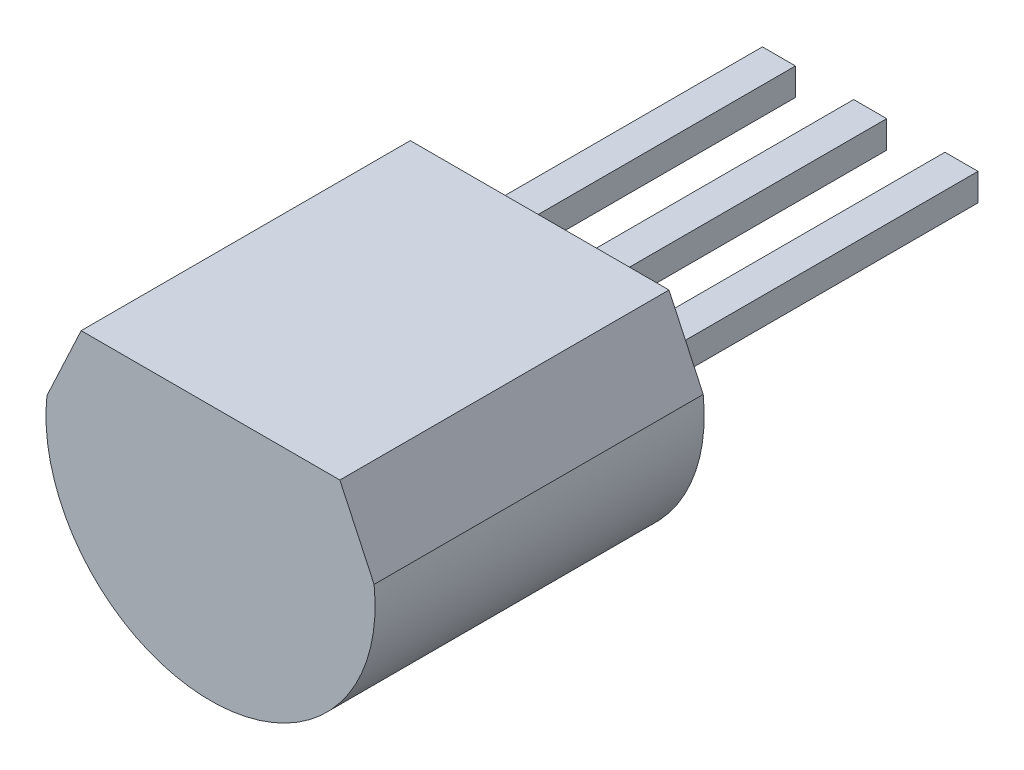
ISO-10303-21;
HEADER;
FILE_DESCRIPTION(('STEP AP214'),'2;1');
FILE_NAME('part.step','',(''),(''),'','','');
FILE_SCHEMA(('AUTOMOTIVE_DESIGN { 1 0 10303 214 1 1 1 1 }'));
ENDSEC;
DATA;
#1=APPLICATION_CONTEXT('core data for automotive mechanical design processes');
#2=APPLICATION_PROTOCOL_DEFINITION('international standard','automotive_design',2000,#1);
#3=PRODUCT_CONTEXT('',#1,'mechanical');
#4=PRODUCT('Part','Part','',(#3));
#5=PRODUCT_RELATED_PRODUCT_CATEGORY('part','',(#4));
#6=PRODUCT_DEFINITION_FORMATION('','',#4);
#7=PRODUCT_DEFINITION_CONTEXT('part definition',#1,'design');
#8=PRODUCT_DEFINITION('design','',#6,#7);
#9=PRODUCT_DEFINITION_SHAPE('','',#8);
#10=(LENGTH_UNIT() NAMED_UNIT(*) SI_UNIT(.MILLI.,.METRE.));
#11=(NAMED_UNIT(*) PLANE_ANGLE_UNIT() SI_UNIT($,.RADIAN.));
#12=(NAMED_UNIT(*) SI_UNIT($,.STERADIAN.) SOLID_ANGLE_UNIT());
#13=UNCERTAINTY_MEASURE_WITH_UNIT(LENGTH_MEASURE(1.E-05),#10,'distance_accuracy_value','');
#14=(GEOMETRIC_REPRESENTATION_CONTEXT(3) GLOBAL_UNCERTAINTY_ASSIGNED_CONTEXT((#13)) GLOBAL_UNIT_ASSIGNED_CONTEXT((#10,
#11,#12)) REPRESENTATION_CONTEXT('',''));
#15=CARTESIAN_POINT('',(0.,0.,0.));
#16=DIRECTION('',(0.,0.,1.));
#17=DIRECTION('',(1.,0.,0.));
#18=AXIS2_PLACEMENT_3D('',#15,#16,#17);
#19=CARTESIAN_POINT('',(1.5,0.19,-3.));
#20=DIRECTION('',(0.,1.,0.));
#21=DIRECTION('',(0.,0.,1.));
#22=AXIS2_PLACEMENT_3D('',#19,#20,#21);
#23=PLANE('',#22);
#24=DIRECTION('',(1.,0.,0.));
#25=VECTOR('',#24,1.);
#26=CARTESIAN_POINT('',(1.04,0.19,1.6));
#27=LINE('',#26,#25);
#28=CARTESIAN_POINT('',(1.5,0.19,1.6));
#29=VERTEX_POINT('',#28);
#30=CARTESIAN_POINT('',(1.04,0.19,1.6));
#31=VERTEX_POINT('',#30);
#32=EDGE_CURVE('P0_E68',#29,#31,#27,.F.);
#33=ORIENTED_EDGE('',*,*,#32,.F.);
#34=DIRECTION('',(0.,0.,-1.));
#35=VECTOR('',#34,1.);
#36=CARTESIAN_POINT('',(1.5,0.19,-3.));
#37=LINE('',#36,#35);
#38=CARTESIAN_POINT('',(1.5,0.19,-3.));
#39=VERTEX_POINT('',#38);
#40=EDGE_CURVE('P0_E55',#39,#29,#37,.F.);
#41=ORIENTED_EDGE('',*,*,#40,.F.);
#42=DIRECTION('',(-1.,0.,0.));
#43=VECTOR('',#42,1.);
#44=CARTESIAN_POINT('',(1.04,0.19,-3.));
#45=LINE('',#44,#43);
#46=CARTESIAN_POINT('',(1.04,0.19,-3.));
#47=VERTEX_POINT('',#46);
#48=EDGE_CURVE('P0_E20',#47,#39,#45,.F.);
#49=ORIENTED_EDGE('',*,*,#48,.F.);
#50=DIRECTION('',(0.,0.,1.));
#51=VECTOR('',#50,1.);
#52=CARTESIAN_POINT('',(1.04,0.19,-3.));
#53=LINE('',#52,#51);
#54=EDGE_CURVE('P0_E81',#31,#47,#53,.F.);
#55=ORIENTED_EDGE('',*,*,#54,.F.);
#56=EDGE_LOOP('',(#33,#41,#49,#55));
#57=FACE_BOUND('',#56,.T.);
#58=ADVANCED_FACE('P0_F17',(#57),#23,.T.);
#59=CARTESIAN_POINT('',(1.04,-0.19,-3.));
#60=DIRECTION('',(0.,0.,-1.));
#61=DIRECTION('',(-1.,0.,0.));
#62=AXIS2_PLACEMENT_3D('',#59,#60,#61);
#63=PLANE('',#62);
#64=DIRECTION('',(0.,1.,0.));
#65=VECTOR('',#64,1.);
#66=CARTESIAN_POINT('',(1.5,-0.19,-3.));
#67=LINE('',#66,#65);
#68=CARTESIAN_POINT('',(1.5,-0.19,-3.));
#69=VERTEX_POINT('',#68);
#70=EDGE_CURVE('P0_E61',#69,#39,#67,.T.);
#71=ORIENTED_EDGE('',*,*,#70,.F.);
#72=DIRECTION('',(1.,0.,0.));
#73=VECTOR('',#72,1.);
#74=CARTESIAN_POINT('',(1.04,-0.19,-3.));
#75=LINE('',#74,#73);
#76=CARTESIAN_POINT('',(1.04,-0.19,-3.));
#77=VERTEX_POINT('',#76);
#78=EDGE_CURVE('P0_E83',#77,#69,#75,.T.);
#79=ORIENTED_EDGE('',*,*,#78,.F.);
#80=DIRECTION('',(0.,1.,0.));
#81=VECTOR('',#80,1.);
#82=CARTESIAN_POINT('',(1.04,0.19,-3.));
#83=LINE('',#82,#81);
#84=EDGE_CURVE('P0_E64',#47,#77,#83,.F.);
#85=ORIENTED_EDGE('',*,*,#84,.F.);
#86=ORIENTED_EDGE('',*,*,#48,.T.);
#87=EDGE_LOOP('',(#71,#79,#85,#86));
#88=FACE_BOUND('',#87,.T.);
#89=ADVANCED_FACE('P0_F60',(#88),#63,.T.);
#90=CARTESIAN_POINT('',(1.5,-0.19,-3.));
#91=DIRECTION('',(1.,0.,0.));
#92=DIRECTION('',(0.,0.,-1.));
#93=AXIS2_PLACEMENT_3D('',#90,#91,#92);
#94=PLANE('',#93);
#95=DIRECTION('',(0.,1.,0.));
#96=VECTOR('',#95,1.);
#97=CARTESIAN_POINT('',(1.5,-0.19,1.6));
#98=LINE('',#97,#96);
#99=CARTESIAN_POINT('',(1.5,-0.19,1.6));
#100=VERTEX_POINT('',#99);
#101=EDGE_CURVE('P0_E70',#100,#29,#98,.T.);
#102=ORIENTED_EDGE('',*,*,#101,.F.);
#103=DIRECTION('',(0.,0.,-1.));
#104=VECTOR('',#103,1.);
#105=CARTESIAN_POINT('',(1.5,-0.19,-3.));
#106=LINE('',#105,#104);
#107=EDGE_CURVE('P0_E74',#69,#100,#106,.F.);
#108=ORIENTED_EDGE('',*,*,#107,.F.);
#109=ORIENTED_EDGE('',*,*,#70,.T.);
#110=ORIENTED_EDGE('',*,*,#40,.T.);
#111=EDGE_LOOP('',(#102,#108,#109,#110));
#112=FACE_BOUND('',#111,.T.);
#113=ADVANCED_FACE('P0_F72',(#112),#94,.T.);
#114=CARTESIAN_POINT('',(1.04,-0.19,1.6));
#115=DIRECTION('',(0.,0.,1.));
#116=DIRECTION('',(1.,0.,0.));
#117=AXIS2_PLACEMENT_3D('',#114,#115,#116);
#118=PLANE('',#117);
#119=ORIENTED_EDGE('',*,*,#32,.T.);
#120=DIRECTION('',(0.,1.,0.));
#121=VECTOR('',#120,1.);
#122=CARTESIAN_POINT('',(1.04,0.19,1.6));
#123=LINE('',#122,#121);
#124=CARTESIAN_POINT('',(1.04,-0.19,1.6));
#125=VERTEX_POINT('',#124);
#126=EDGE_CURVE('P0_E35',#125,#31,#123,.T.);
#127=ORIENTED_EDGE('',*,*,#126,.F.);
#128=DIRECTION('',(1.,0.,0.));
#129=VECTOR('',#128,1.);
#130=CARTESIAN_POINT('',(1.04,-0.19,1.6));
#131=LINE('',#130,#129);
#132=EDGE_CURVE('P0_E26',#100,#125,#131,.F.);
#133=ORIENTED_EDGE('',*,*,#132,.F.);
#134=ORIENTED_EDGE('',*,*,#101,.T.);
#135=EDGE_LOOP('',(#119,#127,#133,#134));
#136=FACE_BOUND('',#135,.T.);
#137=ADVANCED_FACE('P0_F89',(#136),#118,.T.);
#138=CARTESIAN_POINT('',(1.04,0.19,-3.));
#139=DIRECTION('',(-1.,0.,0.));
#140=DIRECTION('',(0.,0.,1.));
#141=AXIS2_PLACEMENT_3D('',#138,#139,#140);
#142=PLANE('',#141);
#143=ORIENTED_EDGE('',*,*,#126,.T.);
#144=ORIENTED_EDGE('',*,*,#54,.T.);
#145=ORIENTED_EDGE('',*,*,#84,.T.);
#146=DIRECTION('',(0.,0.,-1.));
#147=VECTOR('',#146,1.);
#148=CARTESIAN_POINT('',(1.04,-0.19,-3.));
#149=LINE('',#148,#147);
#150=EDGE_CURVE('P0_E11',#125,#77,#149,.T.);
#151=ORIENTED_EDGE('',*,*,#150,.F.);
#152=EDGE_LOOP('',(#143,#144,#145,#151));
#153=FACE_BOUND('',#152,.T.);
#154=ADVANCED_FACE('P0_F91',(#153),#142,.T.);
#155=CARTESIAN_POINT('',(1.04,-0.19,-3.));
#156=DIRECTION('',(0.,-1.,0.));
#157=DIRECTION('',(0.,0.,-1.));
#158=AXIS2_PLACEMENT_3D('',#155,#156,#157);
#159=PLANE('',#158);
#160=ORIENTED_EDGE('',*,*,#132,.T.);
#161=ORIENTED_EDGE('',*,*,#150,.T.);
#162=ORIENTED_EDGE('',*,*,#78,.T.);
#163=ORIENTED_EDGE('',*,*,#107,.T.);
#164=EDGE_LOOP('',(#160,#161,#162,#163));
#165=FACE_BOUND('',#164,.T.);
#166=ADVANCED_FACE('P0_F88',(#165),#159,.T.);
#167=CLOSED_SHELL('',(#58,#89,#113,#137,#154,#166));
#168=MANIFOLD_SOLID_BREP('P0_B1',#167);
#169=CARTESIAN_POINT('',(0.23,0.19,-3.));
#170=DIRECTION('',(0.,1.,0.));
#171=DIRECTION('',(0.,0.,1.));
#172=AXIS2_PLACEMENT_3D('',#169,#170,#171);
#173=PLANE('',#172);
#174=DIRECTION('',(1.,0.,0.));
#175=VECTOR('',#174,1.);
#176=CARTESIAN_POINT('',(-0.23,0.19,1.6));
#177=LINE('',#176,#175);
#178=CARTESIAN_POINT('',(0.23,0.19,1.6));
#179=VERTEX_POINT('',#178);
#180=CARTESIAN_POINT('',(-0.23,0.19,1.6));
#181=VERTEX_POINT('',#180);
#182=EDGE_CURVE('P1_E68',#179,#181,#177,.F.);
#183=ORIENTED_EDGE('',*,*,#182,.F.);
#184=DIRECTION('',(0.,0.,-1.));
#185=VECTOR('',#184,1.);
#186=CARTESIAN_POINT('',(0.23,0.19,-3.));
#187=LINE('',#186,#185);
#188=CARTESIAN_POINT('',(0.23,0.19,-3.));
#189=VERTEX_POINT('',#188);
#190=EDGE_CURVE('P1_E55',#189,#179,#187,.F.);
#191=ORIENTED_EDGE('',*,*,#190,.F.);
#192=DIRECTION('',(-1.,0.,0.));
#193=VECTOR('',#192,1.);
#194=CARTESIAN_POINT('',(-0.23,0.19,-3.));
#195=LINE('',#194,#193);
#196=CARTESIAN_POINT('',(-0.23,0.19,-3.));
#197=VERTEX_POINT('',#196);
#198=EDGE_CURVE('P1_E20',#197,#189,#195,.F.);
#199=ORIENTED_EDGE('',*,*,#198,.F.);
#200=DIRECTION('',(0.,0.,1.));
#201=VECTOR('',#200,1.);
#202=CARTESIAN_POINT('',(-0.23,0.19,-3.));
#203=LINE('',#202,#201);
#204=EDGE_CURVE('P1_E81',#181,#197,#203,.F.);
#205=ORIENTED_EDGE('',*,*,#204,.F.);
#206=EDGE_LOOP('',(#183,#191,#199,#205));
#207=FACE_BOUND('',#206,.T.);
#208=ADVANCED_FACE('P1_F17',(#207),#173,.T.);
#209=CARTESIAN_POINT('',(-0.23,-0.19,-3.));
#210=DIRECTION('',(0.,0.,-1.));
#211=DIRECTION('',(-1.,0.,0.));
#212=AXIS2_PLACEMENT_3D('',#209,#210,#211);
#213=PLANE('',#212);
#214=DIRECTION('',(0.,1.,0.));
#215=VECTOR('',#214,1.);
#216=CARTESIAN_POINT('',(0.23,-0.19,-3.));
#217=LINE('',#216,#215);
#218=CARTESIAN_POINT('',(0.23,-0.19,-3.));
#219=VERTEX_POINT('',#218);
#220=EDGE_CURVE('P1_E61',#219,#189,#217,.T.);
#221=ORIENTED_EDGE('',*,*,#220,.F.);
#222=DIRECTION('',(1.,0.,0.));
#223=VECTOR('',#222,1.);
#224=CARTESIAN_POINT('',(-0.23,-0.19,-3.));
#225=LINE('',#224,#223);
#226=CARTESIAN_POINT('',(-0.23,-0.19,-3.));
#227=VERTEX_POINT('',#226);
#228=EDGE_CURVE('P1_E83',#227,#219,#225,.T.);
#229=ORIENTED_EDGE('',*,*,#228,.F.);
#230=DIRECTION('',(0.,1.,0.));
#231=VECTOR('',#230,1.);
#232=CARTESIAN_POINT('',(-0.23,0.19,-3.));
#233=LINE('',#232,#231);
#234=EDGE_CURVE('P1_E64',#197,#227,#233,.F.);
#235=ORIENTED_EDGE('',*,*,#234,.F.);
#236=ORIENTED_EDGE('',*,*,#198,.T.);
#237=EDGE_LOOP('',(#221,#229,#235,#236));
#238=FACE_BOUND('',#237,.T.);
#239=ADVANCED_FACE('P1_F60',(#238),#213,.T.);
#240=CARTESIAN_POINT('',(0.23,-0.19,-3.));
#241=DIRECTION('',(1.,0.,0.));
#242=DIRECTION('',(0.,0.,-1.));
#243=AXIS2_PLACEMENT_3D('',#240,#241,#242);
#244=PLANE('',#243);
#245=DIRECTION('',(0.,1.,0.));
#246=VECTOR('',#245,1.);
#247=CARTESIAN_POINT('',(0.23,-0.19,1.6));
#248=LINE('',#247,#246);
#249=CARTESIAN_POINT('',(0.23,-0.19,1.6));
#250=VERTEX_POINT('',#249);
#251=EDGE_CURVE('P1_E70',#250,#179,#248,.T.);
#252=ORIENTED_EDGE('',*,*,#251,.F.);
#253=DIRECTION('',(0.,0.,-1.));
#254=VECTOR('',#253,1.);
#255=CARTESIAN_POINT('',(0.23,-0.19,-3.));
#256=LINE('',#255,#254);
#257=EDGE_CURVE('P1_E74',#219,#250,#256,.F.);
#258=ORIENTED_EDGE('',*,*,#257,.F.);
#259=ORIENTED_EDGE('',*,*,#220,.T.);
#260=ORIENTED_EDGE('',*,*,#190,.T.);
#261=EDGE_LOOP('',(#252,#258,#259,#260));
#262=FACE_BOUND('',#261,.T.);
#263=ADVANCED_FACE('P1_F72',(#262),#244,.T.);
#264=CARTESIAN_POINT('',(-0.23,-0.19,1.6));
#265=DIRECTION('',(0.,0.,1.));
#266=DIRECTION('',(1.,0.,0.));
#267=AXIS2_PLACEMENT_3D('',#264,#265,#266);
#268=PLANE('',#267);
#269=ORIENTED_EDGE('',*,*,#182,.T.);
#270=DIRECTION('',(0.,1.,0.));
#271=VECTOR('',#270,1.);
#272=CARTESIAN_POINT('',(-0.23,0.19,1.6));
#273=LINE('',#272,#271);
#274=CARTESIAN_POINT('',(-0.23,-0.19,1.6));
#275=VERTEX_POINT('',#274);
#276=EDGE_CURVE('P1_E35',#275,#181,#273,.T.);
#277=ORIENTED_EDGE('',*,*,#276,.F.);
#278=DIRECTION('',(1.,0.,0.));
#279=VECTOR('',#278,1.);
#280=CARTESIAN_POINT('',(-0.23,-0.19,1.6));
#281=LINE('',#280,#279);
#282=EDGE_CURVE('P1_E26',#250,#275,#281,.F.);
#283=ORIENTED_EDGE('',*,*,#282,.F.);
#284=ORIENTED_EDGE('',*,*,#251,.T.);
#285=EDGE_LOOP('',(#269,#277,#283,#284));
#286=FACE_BOUND('',#285,.T.);
#287=ADVANCED_FACE('P1_F89',(#286),#268,.T.);
#288=CARTESIAN_POINT('',(-0.23,0.19,-3.));
#289=DIRECTION('',(-1.,0.,0.));
#290=DIRECTION('',(0.,0.,1.));
#291=AXIS2_PLACEMENT_3D('',#288,#289,#290);
#292=PLANE('',#291);
#293=ORIENTED_EDGE('',*,*,#276,.T.);
#294=ORIENTED_EDGE('',*,*,#204,.T.);
#295=ORIENTED_EDGE('',*,*,#234,.T.);
#296=DIRECTION('',(0.,0.,-1.));
#297=VECTOR('',#296,1.);
#298=CARTESIAN_POINT('',(-0.23,-0.19,-3.));
#299=LINE('',#298,#297);
#300=EDGE_CURVE('P1_E11',#275,#227,#299,.T.);
#301=ORIENTED_EDGE('',*,*,#300,.F.);
#302=EDGE_LOOP('',(#293,#294,#295,#301));
#303=FACE_BOUND('',#302,.T.);
#304=ADVANCED_FACE('P1_F91',(#303),#292,.T.);
#305=CARTESIAN_POINT('',(-0.23,-0.19,-3.));
#306=DIRECTION('',(0.,-1.,0.));
#307=DIRECTION('',(0.,0.,-1.));
#308=AXIS2_PLACEMENT_3D('',#305,#306,#307);
#309=PLANE('',#308);
#310=ORIENTED_EDGE('',*,*,#282,.T.);
#311=ORIENTED_EDGE('',*,*,#300,.T.);
#312=ORIENTED_EDGE('',*,*,#228,.T.);
#313=ORIENTED_EDGE('',*,*,#257,.T.);
#314=EDGE_LOOP('',(#310,#311,#312,#313));
#315=FACE_BOUND('',#314,.T.);
#316=ADVANCED_FACE('P1_F88',(#315),#309,.T.);
#317=CLOSED_SHELL('',(#208,#239,#263,#287,#304,#316));
#318=MANIFOLD_SOLID_BREP('P1_B1',#317);
#319=CARTESIAN_POINT('',(1.8,1.21,1.6));
#320=DIRECTION('',(0.,1.,0.));
#321=DIRECTION('',(-1.,0.,0.));
#322=AXIS2_PLACEMENT_3D('',#319,#320,#321);
#323=PLANE('',#322);
#324=DIRECTION('',(1.,0.,0.));
#325=VECTOR('',#324,1.);
#326=CARTESIAN_POINT('',(-2.862499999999,1.21,6.18));
#327=LINE('',#326,#325);
#328=CARTESIAN_POINT('',(1.8,1.21,6.18));
#329=VERTEX_POINT('',#328);
#330=CARTESIAN_POINT('',(-1.8,1.21,6.18));
#331=VERTEX_POINT('',#330);
#332=EDGE_CURVE('P2_E67',#329,#331,#327,.F.);
#333=ORIENTED_EDGE('',*,*,#332,.F.);
#334=DIRECTION('',(0.,0.,1.));
#335=VECTOR('',#334,1.);
#336=CARTESIAN_POINT('',(1.8,1.21,3.89));
#337=LINE('',#336,#335);
#338=CARTESIAN_POINT('',(1.8,1.21,1.6));
#339=VERTEX_POINT('',#338);
#340=EDGE_CURVE('P2_E89',#339,#329,#337,.T.);
#341=ORIENTED_EDGE('',*,*,#340,.F.);
#342=DIRECTION('',(-1.,0.,0.));
#343=VECTOR('',#342,1.);
#344=CARTESIAN_POINT('',(-2.862499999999,1.21,1.6));
#345=LINE('',#344,#343);
#346=CARTESIAN_POINT('',(-1.8,1.21,1.6));
#347=VERTEX_POINT('',#346);
#348=EDGE_CURVE('P2_E78',#347,#339,#345,.F.);
#349=ORIENTED_EDGE('',*,*,#348,.F.);
#350=DIRECTION('',(0.,0.,-1.));
#351=VECTOR('',#350,1.);
#352=CARTESIAN_POINT('',(-1.8,1.21,3.89));
#353=LINE('',#352,#351);
#354=EDGE_CURVE('P2_E111',#331,#347,#353,.T.);
#355=ORIENTED_EDGE('',*,*,#354,.F.);
#356=EDGE_LOOP('',(#333,#341,#349,#355));
#357=FACE_BOUND('',#356,.T.);
#358=ADVANCED_FACE('P2_F17',(#357),#323,.T.);
#359=CARTESIAN_POINT('',(-0.79375,-2.1,3.09625));
#360=DIRECTION('',(0.,-1.,0.));
#361=DIRECTION('',(0.,0.,-1.));
#362=AXIS2_PLACEMENT_3D('',#359,#360,#361);
#363=PLANE('',#362);
#364=CARTESIAN_POINT('',(0.,-2.1,3.89));
#365=DIRECTION('',(0.,-1.,0.));
#366=DIRECTION('',(0.,0.,-1.));
#367=AXIS2_PLACEMENT_3D('',#364,#365,#366);
#368=CIRCLE('',#367,0.635000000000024);
#369=CARTESIAN_POINT('',(-0.635000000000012,-2.1,3.89));
#370=VERTEX_POINT('',#369);
#371=CARTESIAN_POINT('',(0.635000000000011,-2.1,3.89));
#372=VERTEX_POINT('',#371);
#373=EDGE_CURVE('P2_E60',#370,#372,#368,.F.);
#374=ORIENTED_EDGE('',*,*,#373,.F.);
#375=CARTESIAN_POINT('',(0.,-2.1,3.89));
#376=DIRECTION('',(0.,-1.,0.));
#377=DIRECTION('',(0.,0.,-1.));
#378=AXIS2_PLACEMENT_3D('',#375,#376,#377);
#379=CIRCLE('',#378,0.635000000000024);
#380=EDGE_CURVE('P2_E22',#372,#370,#379,.F.);
#381=ORIENTED_EDGE('',*,*,#380,.F.);
#382=EDGE_LOOP('',(#374,#381));
#383=FACE_BOUND('',#382,.T.);
#384=ADVANCED_FACE('P2_F144',(#383),#363,.T.);
#385=CARTESIAN_POINT('',(-2.862499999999,-2.795,1.6));
#386=DIRECTION('',(0.,0.,-1.));
#387=DIRECTION('',(-1.,0.,0.));
#388=AXIS2_PLACEMENT_3D('',#385,#386,#387);
#389=PLANE('',#388);
#390=DIRECTION('',(-0.423113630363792,0.906076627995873,0.));
#391=VECTOR('',#390,1.);
#392=CARTESIAN_POINT('',(2.038156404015,0.700000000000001,1.6));
#393=LINE('',#392,#391);
#394=CARTESIAN_POINT('',(2.27631280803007,0.189999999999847,1.6));
#395=VERTEX_POINT('',#394);
#396=EDGE_CURVE('P2_E82',#395,#339,#393,.T.);
#397=ORIENTED_EDGE('',*,*,#396,.F.);
#398=CARTESIAN_POINT('',(1.55257751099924E-13,-0.0600000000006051,1.6));
#399=DIRECTION('',(0.,0.,1.));
#400=DIRECTION('',(1.,0.,0.));
#401=AXIS2_PLACEMENT_3D('',#398,#399,#400);
#402=CIRCLE('',#401,2.29000000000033);
#403=CARTESIAN_POINT('',(-2.27631280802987,0.190000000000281,1.6));
#404=VERTEX_POINT('',#403);
#405=EDGE_CURVE('P2_E166',#404,#395,#402,.T.);
#406=ORIENTED_EDGE('',*,*,#405,.F.);
#407=DIRECTION('',(-0.423113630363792,-0.906076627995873,0.));
#408=VECTOR('',#407,1.);
#409=CARTESIAN_POINT('',(-2.038156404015,0.7,1.6));
#410=LINE('',#409,#408);
#411=EDGE_CURVE('P2_E85',#347,#404,#410,.T.);
#412=ORIENTED_EDGE('',*,*,#411,.F.);
#413=ORIENTED_EDGE('',*,*,#348,.T.);
#414=EDGE_LOOP('',(#397,#406,#412,#413));
#415=FACE_BOUND('',#414,.T.);
#416=ADVANCED_FACE('P2_F80',(#415),#389,.T.);
#417=CARTESIAN_POINT('',(2.27631280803,0.19,1.6));
#418=DIRECTION('',(0.906076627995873,0.423113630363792,0.));
#419=DIRECTION('',(-0.423113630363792,0.906076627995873,0.));
#420=AXIS2_PLACEMENT_3D('',#417,#418,#419);
#421=PLANE('',#420);
#422=DIRECTION('',(-0.423113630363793,0.906076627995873,0.));
#423=VECTOR('',#422,1.);
#424=CARTESIAN_POINT('',(2.27631280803,0.19,6.18));
#425=LINE('',#424,#423);
#426=CARTESIAN_POINT('',(2.27631280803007,0.189999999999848,6.18));
#427=VERTEX_POINT('',#426);
#428=EDGE_CURVE('P2_E91',#427,#329,#425,.T.);
#429=ORIENTED_EDGE('',*,*,#428,.F.);
#430=DIRECTION('',(0.,0.,1.));
#431=VECTOR('',#430,1.);
#432=CARTESIAN_POINT('',(2.27631280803,0.19,3.89));
#433=LINE('',#432,#431);
#434=EDGE_CURVE('P2_E95',#395,#427,#433,.T.);
#435=ORIENTED_EDGE('',*,*,#434,.F.);
#436=ORIENTED_EDGE('',*,*,#396,.T.);
#437=ORIENTED_EDGE('',*,*,#340,.T.);
#438=EDGE_LOOP('',(#429,#435,#436,#437));
#439=FACE_BOUND('',#438,.T.);
#440=ADVANCED_FACE('P2_F93',(#439),#421,.T.);
#441=CARTESIAN_POINT('',(-2.862499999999,-2.795,6.18));
#442=DIRECTION('',(0.,0.,1.));
#443=DIRECTION('',(1.,0.,0.));
#444=AXIS2_PLACEMENT_3D('',#441,#442,#443);
#445=PLANE('',#444);
#446=ORIENTED_EDGE('',*,*,#332,.T.);
#447=DIRECTION('',(0.423113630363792,0.906076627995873,0.));
#448=VECTOR('',#447,1.);
#449=CARTESIAN_POINT('',(-2.038156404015,0.7,6.18));
#450=LINE('',#449,#448);
#451=CARTESIAN_POINT('',(-2.27631280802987,0.190000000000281,6.18));
#452=VERTEX_POINT('',#451);
#453=EDGE_CURVE('P2_E105',#452,#331,#450,.T.);
#454=ORIENTED_EDGE('',*,*,#453,.F.);
#455=CARTESIAN_POINT('',(1.55257751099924E-13,-0.0600000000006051,6.18));
#456=DIRECTION('',(0.,0.,1.));
#457=DIRECTION('',(1.,0.,0.));
#458=AXIS2_PLACEMENT_3D('',#455,#456,#457);
#459=CIRCLE('',#458,2.29000000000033);
#460=EDGE_CURVE('P2_E162',#427,#452,#459,.F.);
#461=ORIENTED_EDGE('',*,*,#460,.F.);
#462=ORIENTED_EDGE('',*,*,#428,.T.);
#463=EDGE_LOOP('',(#446,#454,#461,#462));
#464=FACE_BOUND('',#463,.T.);
#465=ADVANCED_FACE('P2_F138',(#464),#445,.T.);
#466=CARTESIAN_POINT('',(-1.8,1.21,1.6));
#467=DIRECTION('',(-0.906076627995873,0.423113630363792,0.));
#468=DIRECTION('',(-0.423113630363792,-0.906076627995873,0.));
#469=AXIS2_PLACEMENT_3D('',#466,#467,#468);
#470=PLANE('',#469);
#471=ORIENTED_EDGE('',*,*,#453,.T.);
#472=ORIENTED_EDGE('',*,*,#354,.T.);
#473=ORIENTED_EDGE('',*,*,#411,.T.);
#474=DIRECTION('',(0.,0.,-1.));
#475=VECTOR('',#474,1.);
#476=CARTESIAN_POINT('',(-2.27631280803,0.19,3.89));
#477=LINE('',#476,#475);
#478=EDGE_CURVE('P2_E164',#452,#404,#477,.T.);
#479=ORIENTED_EDGE('',*,*,#478,.F.);
#480=EDGE_LOOP('',(#471,#472,#473,#479));
#481=FACE_BOUND('',#480,.T.);
#482=ADVANCED_FACE('P2_F135',(#481),#470,.T.);
#483=CARTESIAN_POINT('',(0.,-2.1,3.89));
#484=DIRECTION('',(0.,-1.,0.));
#485=DIRECTION('',(0.,0.,-1.));
#486=AXIS2_PLACEMENT_3D('',#483,#484,#485);
#487=CYLINDRICAL_SURFACE('',#486,0.635000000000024);
#488=DIRECTION('',(0.,-1.,0.));
#489=VECTOR('',#488,1.);
#490=CARTESIAN_POINT('',(0.635,-2.35,3.89));
#491=LINE('',#490,#489);
#492=CARTESIAN_POINT('',(0.635000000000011,-2.26019885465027,3.89));
#493=VERTEX_POINT('',#492);
#494=EDGE_CURVE('P2_E169',#372,#493,#491,.T.);
#495=ORIENTED_EDGE('',*,*,#494,.F.);
#496=ORIENTED_EDGE('',*,*,#380,.T.);
#497=DIRECTION('',(0.,1.,0.));
#498=VECTOR('',#497,1.);
#499=CARTESIAN_POINT('',(-0.635,-2.35,3.89));
#500=LINE('',#499,#498);
#501=CARTESIAN_POINT('',(-0.635000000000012,-2.26019885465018,3.89));
#502=VERTEX_POINT('',#501);
#503=EDGE_CURVE('P2_E37',#502,#370,#500,.T.);
#504=ORIENTED_EDGE('',*,*,#503,.F.);
#505=CARTESIAN_POINT('',(0.635000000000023,-2.26019885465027,3.89));
#506=CARTESIAN_POINT('',(0.63503346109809,-2.26016541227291,3.85500812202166));
#507=CARTESIAN_POINT('',(0.632110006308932,-2.26103278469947,3.82004133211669));
#508=CARTESIAN_POINT('',(0.620615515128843,-2.26431381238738,3.7512032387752));
#509=CARTESIAN_POINT('',(0.61205764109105,-2.26672386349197,3.71732957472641));
#510=CARTESIAN_POINT('',(0.589560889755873,-2.27283639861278,3.65155863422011));
#511=CARTESIAN_POINT('',(0.575623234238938,-2.27653858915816,3.61966091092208));
#512=CARTESIAN_POINT('',(0.542794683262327,-2.28480595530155,3.55864035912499));
#513=CARTESIAN_POINT('',(0.523901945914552,-2.28937145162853,3.52951856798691));
#514=CARTESIAN_POINT('',(0.48115561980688,-2.29899060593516,3.47410523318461));
#515=CARTESIAN_POINT('',(0.457192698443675,-2.30405342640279,3.44789959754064));
#516=CARTESIAN_POINT('',(0.405219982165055,-2.31401775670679,3.39982127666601));
#517=CARTESIAN_POINT('',(0.377209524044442,-2.31891923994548,3.37794930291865));
#518=CARTESIAN_POINT('',(0.317333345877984,-2.32811184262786,3.33879599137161));
#519=CARTESIAN_POINT('',(0.285408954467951,-2.33239083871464,3.32160128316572));
#520=CARTESIAN_POINT('',(0.21898510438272,-2.33975004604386,3.29285736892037));
#521=CARTESIAN_POINT('',(0.184486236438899,-2.34283053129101,3.28130687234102));
#522=CARTESIAN_POINT('',(0.114794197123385,-2.34738084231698,3.26445975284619));
#523=CARTESIAN_POINT('',(0.0796391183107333,-2.34888850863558,3.25901595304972));
#524=CARTESIAN_POINT('',(0.00888372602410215,-2.35025592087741,3.25407295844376));
#525=CARTESIAN_POINT('',(-0.0267165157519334,-2.35011592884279,3.25457281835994));
#526=CARTESIAN_POINT('',(-0.0963232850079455,-2.34823116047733,3.26140102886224));
#527=CARTESIAN_POINT('',(-0.130346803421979,-2.34653022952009,3.26757014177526));
#528=CARTESIAN_POINT('',(-0.196854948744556,-2.34176693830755,3.28530353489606));
#529=CARTESIAN_POINT('',(-0.229339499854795,-2.33870451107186,3.29686808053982));
#530=CARTESIAN_POINT('',(-0.292246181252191,-2.33149861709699,3.32518178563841));
#531=CARTESIAN_POINT('',(-0.32264303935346,-2.32734412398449,3.34198417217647));
#532=CARTESIAN_POINT('',(-0.380238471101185,-2.31839974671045,3.38025518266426));
#533=CARTESIAN_POINT('',(-0.40743643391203,-2.31360974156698,3.40172469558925));
#534=CARTESIAN_POINT('',(-0.45881058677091,-2.30372467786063,3.4495571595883));
#535=CARTESIAN_POINT('',(-0.482857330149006,-2.2986247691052,3.47605829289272));
#536=CARTESIAN_POINT('',(-0.526203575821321,-2.28883492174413,3.53277629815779));
#537=CARTESIAN_POINT('',(-0.545501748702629,-2.28414509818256,3.56299420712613));
#538=CARTESIAN_POINT('',(-0.57891447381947,-2.2756846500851,3.62659217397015));
#539=CARTESIAN_POINT('',(-0.592988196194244,-2.27192134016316,3.65999467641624));
#540=CARTESIAN_POINT('',(-0.615259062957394,-2.26583131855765,3.72880387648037));
#541=CARTESIAN_POINT('',(-0.62346507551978,-2.26350243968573,3.76420746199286));
#542=CARTESIAN_POINT('',(-0.630729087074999,-2.26142780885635,3.81494248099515));
#543=CARTESIAN_POINT('',(-0.632330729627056,-2.26096781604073,3.8299172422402));
#544=CARTESIAN_POINT('',(-0.634465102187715,-2.26035338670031,3.85992554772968));
#545=CARTESIAN_POINT('',(-0.634999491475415,-2.26019847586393,3.87495896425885));
#546=CARTESIAN_POINT('',(-0.635000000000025,-2.26019885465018,3.89));
#547=B_SPLINE_CURVE_WITH_KNOTS('',3,(#505,#506,#507,#508,#509,#510,#511,#512,#513,#514,#515,
#516,#517,#518,#519,#520,#521,#522,#523,#524,#525,#526,#527,#528,#529,#530,#531,#532,#533,#534,
#535,#536,#537,#538,#539,#540,#541,#542,#543,#544,#545,#546),.UNSPECIFIED.,.F.,.F.,(4,2,2,2,2,2,
2,2,2,2,2,2,2,2,2,2,2,2,2,2,4),(0.,0.104804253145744,0.209364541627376,0.313901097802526,
0.4184765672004,0.52559166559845,0.63272433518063,0.741723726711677,0.850698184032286,
0.956985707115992,1.06325632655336,1.16663034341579,1.27000944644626,1.37447536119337,
1.47896119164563,1.58689743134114,1.69486385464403,1.80365712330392,1.91228561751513,
1.95745361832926,2.00255134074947),.UNSPECIFIED.);
#548=EDGE_CURVE('P2_E28',#493,#502,#547,.T.);
#549=ORIENTED_EDGE('',*,*,#548,.F.);
#550=EDGE_LOOP('',(#495,#496,#504,#549));
#551=FACE_BOUND('',#550,.T.);
#552=ADVANCED_FACE('P2_F130',(#551),#487,.F.);
#553=CARTESIAN_POINT('',(0.,-2.1,3.89));
#554=DIRECTION('',(0.,-1.,0.));
#555=DIRECTION('',(0.,0.,-1.));
#556=AXIS2_PLACEMENT_3D('',#553,#554,#555);
#557=CYLINDRICAL_SURFACE('',#556,0.635000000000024);
#558=CARTESIAN_POINT('',(-0.635000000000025,-2.26019885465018,3.89));
#559=CARTESIAN_POINT('',(-0.635033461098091,-2.26016541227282,3.92499187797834));
#560=CARTESIAN_POINT('',(-0.632110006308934,-2.26103278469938,3.95995866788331));
#561=CARTESIAN_POINT('',(-0.620615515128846,-2.26431381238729,4.02879676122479));
#562=CARTESIAN_POINT('',(-0.612057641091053,-2.26672386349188,4.06267042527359));
#563=CARTESIAN_POINT('',(-0.589560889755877,-2.2728363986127,4.12844136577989));
#564=CARTESIAN_POINT('',(-0.575623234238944,-2.27653858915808,4.16033908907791));
#565=CARTESIAN_POINT('',(-0.542794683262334,-2.28480595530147,4.221359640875));
#566=CARTESIAN_POINT('',(-0.523901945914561,-2.28937145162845,4.25048143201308));
#567=CARTESIAN_POINT('',(-0.481155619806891,-2.29899060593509,4.30589476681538));
#568=CARTESIAN_POINT('',(-0.457192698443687,-2.30405342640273,4.33210040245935));
#569=CARTESIAN_POINT('',(-0.405219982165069,-2.31401775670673,4.38017872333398));
#570=CARTESIAN_POINT('',(-0.377209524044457,-2.31891923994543,4.40205069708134));
#571=CARTESIAN_POINT('',(-0.317333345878,-2.32811184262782,4.44120400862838));
#572=CARTESIAN_POINT('',(-0.285408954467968,-2.3323908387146,4.45839871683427));
#573=CARTESIAN_POINT('',(-0.218985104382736,-2.33975004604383,4.48714263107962));
#574=CARTESIAN_POINT('',(-0.184486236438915,-2.34283053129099,4.49869312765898));
#575=CARTESIAN_POINT('',(-0.1147941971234,-2.34738084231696,4.51554024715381));
#576=CARTESIAN_POINT('',(-0.0796391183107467,-2.34888850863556,4.52098404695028));
#577=CARTESIAN_POINT('',(-0.00888372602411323,-2.35025592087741,4.52592704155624));
#578=CARTESIAN_POINT('',(0.0267165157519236,-2.3501159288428,4.52542718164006));
#579=CARTESIAN_POINT('',(0.0963232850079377,-2.34823116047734,4.51859897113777));
#580=CARTESIAN_POINT('',(0.130346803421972,-2.34653022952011,4.51242985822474));
#581=CARTESIAN_POINT('',(0.19685494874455,-2.34176693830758,4.49469646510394));
#582=CARTESIAN_POINT('',(0.22933949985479,-2.33870451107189,4.48313191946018));
#583=CARTESIAN_POINT('',(0.292246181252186,-2.33149861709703,4.4548182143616));
#584=CARTESIAN_POINT('',(0.322643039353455,-2.32734412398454,4.43801582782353));
#585=CARTESIAN_POINT('',(0.380238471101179,-2.3183997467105,4.39974481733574));
#586=CARTESIAN_POINT('',(0.407436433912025,-2.31360974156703,4.37827530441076));
#587=CARTESIAN_POINT('',(0.458810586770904,-2.30372467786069,4.3304428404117));
#588=CARTESIAN_POINT('',(0.482857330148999,-2.29862476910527,4.30394170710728));
#589=CARTESIAN_POINT('',(0.526203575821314,-2.2888349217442,4.24722370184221));
#590=CARTESIAN_POINT('',(0.545501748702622,-2.28414509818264,4.21700579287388));
#591=CARTESIAN_POINT('',(0.578914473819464,-2.27568465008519,4.15340782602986));
#592=CARTESIAN_POINT('',(0.592988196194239,-2.27192134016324,4.12000532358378));
#593=CARTESIAN_POINT('',(0.615259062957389,-2.26583131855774,4.05119612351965));
#594=CARTESIAN_POINT('',(0.623465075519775,-2.26350243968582,4.01579253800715));
#595=CARTESIAN_POINT('',(0.630729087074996,-2.26142780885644,3.96505751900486));
#596=CARTESIAN_POINT('',(0.632330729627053,-2.26096781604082,3.95008275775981));
#597=CARTESIAN_POINT('',(0.634465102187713,-2.2603533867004,3.92007445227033));
#598=CARTESIAN_POINT('',(0.634999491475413,-2.26019847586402,3.90504103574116));
#599=CARTESIAN_POINT('',(0.635000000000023,-2.26019885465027,3.89));
#600=B_SPLINE_CURVE_WITH_KNOTS('',3,(#558,#559,#560,#561,#562,#563,#564,#565,#566,#567,#568,
#569,#570,#571,#572,#573,#574,#575,#576,#577,#578,#579,#580,#581,#582,#583,#584,#585,#586,#587,
#588,#589,#590,#591,#592,#593,#594,#595,#596,#597,#598,#599),.UNSPECIFIED.,.F.,.F.,(4,2,2,2,2,2,
2,2,2,2,2,2,2,2,2,2,2,2,2,2,4),(0.,0.104804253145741,0.209364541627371,0.313901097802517,
0.418476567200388,0.525591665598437,0.632724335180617,0.741723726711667,0.850698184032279,
0.95698570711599,1.06325632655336,1.16663034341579,1.27000944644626,1.37447536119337,
1.47896119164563,1.58689743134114,1.69486385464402,1.80365712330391,1.91228561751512,
1.95745361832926,2.00255134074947),.UNSPECIFIED.);
#601=EDGE_CURVE('P2_E11',#502,#493,#600,.T.);
#602=ORIENTED_EDGE('',*,*,#601,.F.);
#603=ORIENTED_EDGE('',*,*,#503,.T.);
#604=ORIENTED_EDGE('',*,*,#373,.T.);
#605=ORIENTED_EDGE('',*,*,#494,.T.);
#606=EDGE_LOOP('',(#602,#603,#604,#605));
#607=FACE_BOUND('',#606,.T.);
#608=ADVANCED_FACE('P2_F127',(#607),#557,.F.);
#609=CARTESIAN_POINT('',(1.55257751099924E-13,-0.0600000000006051,1.6));
#610=DIRECTION('',(0.,0.,1.));
#611=DIRECTION('',(1.,0.,0.));
#612=AXIS2_PLACEMENT_3D('',#609,#610,#611);
#613=CYLINDRICAL_SURFACE('',#612,2.29000000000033);
#614=ORIENTED_EDGE('',*,*,#548,.T.);
#615=ORIENTED_EDGE('',*,*,#601,.T.);
#616=EDGE_LOOP('',(#614,#615));
#617=FACE_BOUND('',#616,.T.);
#618=ORIENTED_EDGE('',*,*,#460,.T.);
#619=ORIENTED_EDGE('',*,*,#478,.T.);
#620=ORIENTED_EDGE('',*,*,#405,.T.);
#621=ORIENTED_EDGE('',*,*,#434,.T.);
#622=EDGE_LOOP('',(#618,#619,#620,#621));
#623=FACE_BOUND('',#622,.T.);
#624=ADVANCED_FACE('P2_F19',(#617,#623),#613,.T.);
#625=CLOSED_SHELL('',(#358,#384,#416,#440,#465,#482,#552,#608,#624));
#626=MANIFOLD_SOLID_BREP('P2_B1',#625);
#627=CARTESIAN_POINT('',(-1.04,0.19,-3.));
#628=DIRECTION('',(0.,1.,0.));
#629=DIRECTION('',(0.,0.,1.));
#630=AXIS2_PLACEMENT_3D('',#627,#628,#629);
#631=PLANE('',#630);
#632=DIRECTION('',(1.,0.,0.));
#633=VECTOR('',#632,1.);
#634=CARTESIAN_POINT('',(-1.5,0.19,1.6));
#635=LINE('',#634,#633);
#636=CARTESIAN_POINT('',(-1.04,0.19,1.6));
#637=VERTEX_POINT('',#636);
#638=CARTESIAN_POINT('',(-1.5,0.19,1.6));
#639=VERTEX_POINT('',#638);
#640=EDGE_CURVE('P3_E68',#637,#639,#635,.F.);
#641=ORIENTED_EDGE('',*,*,#640,.F.);
#642=DIRECTION('',(0.,0.,-1.));
#643=VECTOR('',#642,1.);
#644=CARTESIAN_POINT('',(-1.04,0.19,-3.));
#645=LINE('',#644,#643);
#646=CARTESIAN_POINT('',(-1.04,0.19,-3.));
#647=VERTEX_POINT('',#646);
#648=EDGE_CURVE('P3_E55',#647,#637,#645,.F.);
#649=ORIENTED_EDGE('',*,*,#648,.F.);
#650=DIRECTION('',(-1.,0.,0.));
#651=VECTOR('',#650,1.);
#652=CARTESIAN_POINT('',(-1.5,0.19,-3.));
#653=LINE('',#652,#651);
#654=CARTESIAN_POINT('',(-1.5,0.19,-3.));
#655=VERTEX_POINT('',#654);
#656=EDGE_CURVE('P3_E20',#655,#647,#653,.F.);
#657=ORIENTED_EDGE('',*,*,#656,.F.);
#658=DIRECTION('',(0.,0.,1.));
#659=VECTOR('',#658,1.);
#660=CARTESIAN_POINT('',(-1.5,0.19,-3.));
#661=LINE('',#660,#659);
#662=EDGE_CURVE('P3_E81',#639,#655,#661,.F.);
#663=ORIENTED_EDGE('',*,*,#662,.F.);
#664=EDGE_LOOP('',(#641,#649,#657,#663));
#665=FACE_BOUND('',#664,.T.);
#666=ADVANCED_FACE('P3_F17',(#665),#631,.T.);
#667=CARTESIAN_POINT('',(-1.5,-0.19,-3.));
#668=DIRECTION('',(0.,0.,-1.));
#669=DIRECTION('',(-1.,0.,0.));
#670=AXIS2_PLACEMENT_3D('',#667,#668,#669);
#671=PLANE('',#670);
#672=DIRECTION('',(0.,1.,0.));
#673=VECTOR('',#672,1.);
#674=CARTESIAN_POINT('',(-1.04,-0.19,-3.));
#675=LINE('',#674,#673);
#676=CARTESIAN_POINT('',(-1.04,-0.19,-3.));
#677=VERTEX_POINT('',#676);
#678=EDGE_CURVE('P3_E61',#677,#647,#675,.T.);
#679=ORIENTED_EDGE('',*,*,#678,.F.);
#680=DIRECTION('',(1.,0.,0.));
#681=VECTOR('',#680,1.);
#682=CARTESIAN_POINT('',(-1.5,-0.19,-3.));
#683=LINE('',#682,#681);
#684=CARTESIAN_POINT('',(-1.5,-0.19,-3.));
#685=VERTEX_POINT('',#684);
#686=EDGE_CURVE('P3_E83',#685,#677,#683,.T.);
#687=ORIENTED_EDGE('',*,*,#686,.F.);
#688=DIRECTION('',(0.,1.,0.));
#689=VECTOR('',#688,1.);
#690=CARTESIAN_POINT('',(-1.5,0.19,-3.));
#691=LINE('',#690,#689);
#692=EDGE_CURVE('P3_E64',#655,#685,#691,.F.);
#693=ORIENTED_EDGE('',*,*,#692,.F.);
#694=ORIENTED_EDGE('',*,*,#656,.T.);
#695=EDGE_LOOP('',(#679,#687,#693,#694));
#696=FACE_BOUND('',#695,.T.);
#697=ADVANCED_FACE('P3_F60',(#696),#671,.T.);
#698=CARTESIAN_POINT('',(-1.04,-0.19,-3.));
#699=DIRECTION('',(1.,0.,0.));
#700=DIRECTION('',(0.,0.,-1.));
#701=AXIS2_PLACEMENT_3D('',#698,#699,#700);
#702=PLANE('',#701);
#703=DIRECTION('',(0.,1.,0.));
#704=VECTOR('',#703,1.);
#705=CARTESIAN_POINT('',(-1.04,-0.19,1.6));
#706=LINE('',#705,#704);
#707=CARTESIAN_POINT('',(-1.04,-0.19,1.6));
#708=VERTEX_POINT('',#707);
#709=EDGE_CURVE('P3_E70',#708,#637,#706,.T.);
#710=ORIENTED_EDGE('',*,*,#709,.F.);
#711=DIRECTION('',(0.,0.,-1.));
#712=VECTOR('',#711,1.);
#713=CARTESIAN_POINT('',(-1.04,-0.19,-3.));
#714=LINE('',#713,#712);
#715=EDGE_CURVE('P3_E74',#677,#708,#714,.F.);
#716=ORIENTED_EDGE('',*,*,#715,.F.);
#717=ORIENTED_EDGE('',*,*,#678,.T.);
#718=ORIENTED_EDGE('',*,*,#648,.T.);
#719=EDGE_LOOP('',(#710,#716,#717,#718));
#720=FACE_BOUND('',#719,.T.);
#721=ADVANCED_FACE('P3_F72',(#720),#702,.T.);
#722=CARTESIAN_POINT('',(-1.5,-0.19,1.6));
#723=DIRECTION('',(0.,0.,1.));
#724=DIRECTION('',(1.,0.,0.));
#725=AXIS2_PLACEMENT_3D('',#722,#723,#724);
#726=PLANE('',#725);
#727=ORIENTED_EDGE('',*,*,#640,.T.);
#728=DIRECTION('',(0.,1.,0.));
#729=VECTOR('',#728,1.);
#730=CARTESIAN_POINT('',(-1.5,0.19,1.6));
#731=LINE('',#730,#729);
#732=CARTESIAN_POINT('',(-1.5,-0.19,1.6));
#733=VERTEX_POINT('',#732);
#734=EDGE_CURVE('P3_E35',#733,#639,#731,.T.);
#735=ORIENTED_EDGE('',*,*,#734,.F.);
#736=DIRECTION('',(1.,0.,0.));
#737=VECTOR('',#736,1.);
#738=CARTESIAN_POINT('',(-1.5,-0.19,1.6));
#739=LINE('',#738,#737);
#740=EDGE_CURVE('P3_E26',#708,#733,#739,.F.);
#741=ORIENTED_EDGE('',*,*,#740,.F.);
#742=ORIENTED_EDGE('',*,*,#709,.T.);
#743=EDGE_LOOP('',(#727,#735,#741,#742));
#744=FACE_BOUND('',#743,.T.);
#745=ADVANCED_FACE('P3_F89',(#744),#726,.T.);
#746=CARTESIAN_POINT('',(-1.5,0.19,-3.));
#747=DIRECTION('',(-1.,0.,0.));
#748=DIRECTION('',(0.,0.,1.));
#749=AXIS2_PLACEMENT_3D('',#746,#747,#748);
#750=PLANE('',#749);
#751=ORIENTED_EDGE('',*,*,#734,.T.);
#752=ORIENTED_EDGE('',*,*,#662,.T.);
#753=ORIENTED_EDGE('',*,*,#692,.T.);
#754=DIRECTION('',(0.,0.,-1.));
#755=VECTOR('',#754,1.);
#756=CARTESIAN_POINT('',(-1.5,-0.19,-3.));
#757=LINE('',#756,#755);
#758=EDGE_CURVE('P3_E11',#733,#685,#757,.T.);
#759=ORIENTED_EDGE('',*,*,#758,.F.);
#760=EDGE_LOOP('',(#751,#752,#753,#759));
#761=FACE_BOUND('',#760,.T.);
#762=ADVANCED_FACE('P3_F91',(#761),#750,.T.);
#763=CARTESIAN_POINT('',(-1.5,-0.19,-3.));
#764=DIRECTION('',(0.,-1.,0.));
#765=DIRECTION('',(0.,0.,-1.));
#766=AXIS2_PLACEMENT_3D('',#763,#764,#765);
#767=PLANE('',#766);
#768=ORIENTED_EDGE('',*,*,#740,.T.);
#769=ORIENTED_EDGE('',*,*,#758,.T.);
#770=ORIENTED_EDGE('',*,*,#686,.T.);
#771=ORIENTED_EDGE('',*,*,#715,.T.);
#772=EDGE_LOOP('',(#768,#769,#770,#771));
#773=FACE_BOUND('',#772,.T.);
#774=ADVANCED_FACE('P3_F88',(#773),#767,.T.);
#775=CLOSED_SHELL('',(#666,#697,#721,#745,#762,#774));
#776=MANIFOLD_SOLID_BREP('P3_B1',#775);
#777=ADVANCED_BREP_SHAPE_REPRESENTATION('',(#18,#168,#318,#626,#776),#14);
#778=SHAPE_DEFINITION_REPRESENTATION(#9,#777);
ENDSEC;
END-ISO-10303-21;
